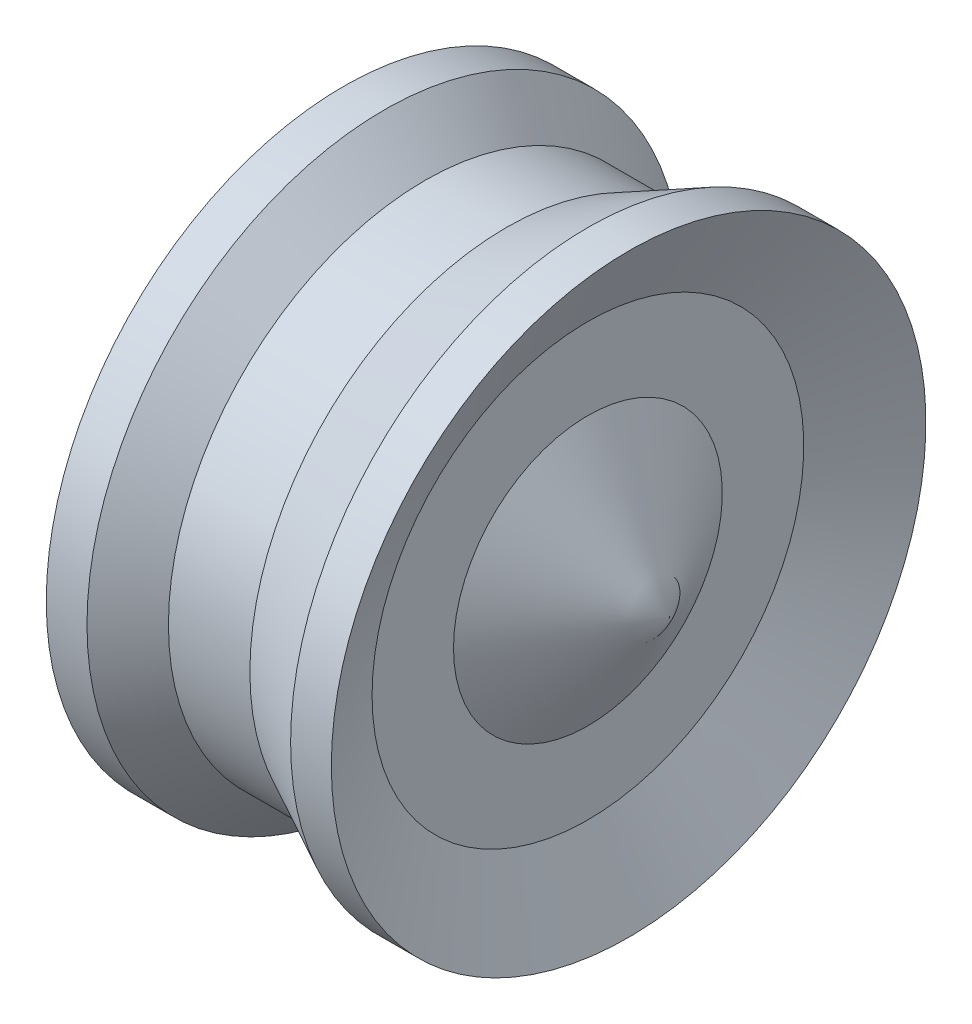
ISO-10303-21;
HEADER;
FILE_DESCRIPTION(('STEP AP214'),'2;1');
FILE_NAME('part.step','',(''),(''),'','','');
FILE_SCHEMA(('AUTOMOTIVE_DESIGN { 1 0 10303 214 1 1 1 1 }'));
ENDSEC;
DATA;
#1=APPLICATION_CONTEXT('core data for automotive mechanical design processes');
#2=APPLICATION_PROTOCOL_DEFINITION('international standard','automotive_design',2000,#1);
#3=PRODUCT_CONTEXT('',#1,'mechanical');
#4=PRODUCT('Part','Part','',(#3));
#5=PRODUCT_RELATED_PRODUCT_CATEGORY('part','',(#4));
#6=PRODUCT_DEFINITION_FORMATION('','',#4);
#7=PRODUCT_DEFINITION_CONTEXT('part definition',#1,'design');
#8=PRODUCT_DEFINITION('design','',#6,#7);
#9=PRODUCT_DEFINITION_SHAPE('','',#8);
#10=(LENGTH_UNIT() NAMED_UNIT(*) SI_UNIT(.MILLI.,.METRE.));
#11=(NAMED_UNIT(*) PLANE_ANGLE_UNIT() SI_UNIT($,.RADIAN.));
#12=(NAMED_UNIT(*) SI_UNIT($,.STERADIAN.) SOLID_ANGLE_UNIT());
#13=UNCERTAINTY_MEASURE_WITH_UNIT(LENGTH_MEASURE(1.E-05),#10,'distance_accuracy_value','');
#14=(GEOMETRIC_REPRESENTATION_CONTEXT(3) GLOBAL_UNCERTAINTY_ASSIGNED_CONTEXT((#13)) GLOBAL_UNIT_ASSIGNED_CONTEXT((#10,
#11,#12)) REPRESENTATION_CONTEXT('',''));
#15=CARTESIAN_POINT('',(0.,0.,0.));
#16=DIRECTION('',(0.,0.,1.));
#17=DIRECTION('',(1.,0.,0.));
#18=AXIS2_PLACEMENT_3D('',#15,#16,#17);
#19=CARTESIAN_POINT('',(0.,0.,0.));
#20=DIRECTION('',(-1.,0.,0.));
#21=DIRECTION('',(0.,0.,1.));
#22=AXIS2_PLACEMENT_3D('',#19,#20,#21);
#23=PLANE('',#22);
#24=CARTESIAN_POINT('',(0.,0.,0.));
#25=DIRECTION('',(-1.,0.,0.));
#26=DIRECTION('',(0.,0.,1.));
#27=AXIS2_PLACEMENT_3D('',#24,#25,#26);
#28=CIRCLE('',#27,2.);
#29=CARTESIAN_POINT('',(0.,0.,2.));
#30=VERTEX_POINT('',#29);
#31=EDGE_CURVE('E11',#30,#30,#28,.T.);
#32=ORIENTED_EDGE('',*,*,#31,.T.);
#33=EDGE_LOOP('',(#32));
#34=FACE_BOUND('',#33,.T.);
#35=ADVANCED_FACE('F43',(#34),#23,.T.);
#36=CARTESIAN_POINT('',(0.,0.,0.));
#37=DIRECTION('',(-1.,0.,0.));
#38=DIRECTION('',(0.,0.,1.));
#39=AXIS2_PLACEMENT_3D('',#36,#37,#38);
#40=CYLINDRICAL_SURFACE('',#39,2.);
#41=CARTESIAN_POINT('',(-0.5,0.,0.));
#42=DIRECTION('',(-1.,0.,0.));
#43=DIRECTION('',(0.,0.,1.));
#44=AXIS2_PLACEMENT_3D('',#41,#42,#43);
#45=CIRCLE('',#44,2.);
#46=CARTESIAN_POINT('',(-0.5,0.,2.));
#47=VERTEX_POINT('',#46);
#48=EDGE_CURVE('E49',#47,#47,#45,.T.);
#49=ORIENTED_EDGE('',*,*,#48,.T.);
#50=EDGE_LOOP('',(#49));
#51=FACE_BOUND('',#50,.T.);
#52=ORIENTED_EDGE('',*,*,#31,.F.);
#53=EDGE_LOOP('',(#52));
#54=FACE_BOUND('',#53,.T.);
#55=ADVANCED_FACE('F94',(#51,#54),#40,.F.);
#56=CARTESIAN_POINT('',(-0.5,-2.,0.));
#57=DIRECTION('',(1.,0.,0.));
#58=DIRECTION('',(0.,0.,-1.));
#59=AXIS2_PLACEMENT_3D('',#56,#57,#58);
#60=PLANE('',#59);
#61=CARTESIAN_POINT('',(-0.5,0.,0.));
#62=DIRECTION('',(-1.,0.,0.));
#63=DIRECTION('',(0.,0.,1.));
#64=AXIS2_PLACEMENT_3D('',#61,#62,#63);
#65=CIRCLE('',#64,1.5);
#66=CARTESIAN_POINT('',(-0.5,0.,1.5));
#67=VERTEX_POINT('',#66);
#68=EDGE_CURVE('E89',#67,#67,#65,.T.);
#69=ORIENTED_EDGE('',*,*,#68,.T.);
#70=EDGE_LOOP('',(#69));
#71=FACE_BOUND('',#70,.T.);
#72=ORIENTED_EDGE('',*,*,#48,.F.);
#73=EDGE_LOOP('',(#72));
#74=FACE_BOUND('',#73,.T.);
#75=ADVANCED_FACE('F97',(#71,#74),#60,.T.);
#76=CARTESIAN_POINT('',(0.,0.,0.));
#77=DIRECTION('',(-1.,0.,0.));
#78=DIRECTION('',(0.,0.,1.));
#79=AXIS2_PLACEMENT_3D('',#76,#77,#78);
#80=CYLINDRICAL_SURFACE('',#79,1.5);
#81=CARTESIAN_POINT('',(-2.,0.,0.));
#82=DIRECTION('',(-1.,0.,0.));
#83=DIRECTION('',(0.,0.,1.));
#84=AXIS2_PLACEMENT_3D('',#81,#82,#83);
#85=CIRCLE('',#84,1.5);
#86=CARTESIAN_POINT('',(-2.,0.,1.5));
#87=VERTEX_POINT('',#86);
#88=EDGE_CURVE('E86',#87,#87,#85,.T.);
#89=ORIENTED_EDGE('',*,*,#88,.T.);
#90=EDGE_LOOP('',(#89));
#91=FACE_BOUND('',#90,.T.);
#92=ORIENTED_EDGE('',*,*,#68,.F.);
#93=EDGE_LOOP('',(#92));
#94=FACE_BOUND('',#93,.T.);
#95=ADVANCED_FACE('F99',(#91,#94),#80,.F.);
#96=CARTESIAN_POINT('',(-2.,-1.5,0.));
#97=DIRECTION('',(-1.,0.,0.));
#98=DIRECTION('',(0.,0.,1.));
#99=AXIS2_PLACEMENT_3D('',#96,#97,#98);
#100=PLANE('',#99);
#101=CARTESIAN_POINT('',(-2.,0.,0.));
#102=DIRECTION('',(-1.,0.,0.));
#103=DIRECTION('',(0.,0.,1.));
#104=AXIS2_PLACEMENT_3D('',#101,#102,#103);
#105=CIRCLE('',#104,3.65);
#106=CARTESIAN_POINT('',(-2.,0.,3.65));
#107=VERTEX_POINT('',#106);
#108=EDGE_CURVE('E83',#107,#107,#105,.T.);
#109=ORIENTED_EDGE('',*,*,#108,.T.);
#110=EDGE_LOOP('',(#109));
#111=FACE_BOUND('',#110,.T.);
#112=ORIENTED_EDGE('',*,*,#88,.F.);
#113=EDGE_LOOP('',(#112));
#114=FACE_BOUND('',#113,.T.);
#115=ADVANCED_FACE('F106',(#111,#114),#100,.T.);
#116=CARTESIAN_POINT('',(0.,0.,0.));
#117=DIRECTION('',(-1.,0.,0.));
#118=DIRECTION('',(0.,0.,1.));
#119=AXIS2_PLACEMENT_3D('',#116,#117,#118);
#120=CYLINDRICAL_SURFACE('',#119,3.65);
#121=CARTESIAN_POINT('',(-1.5,0.,0.));
#122=DIRECTION('',(-1.,0.,0.));
#123=DIRECTION('',(0.,0.,1.));
#124=AXIS2_PLACEMENT_3D('',#121,#122,#123);
#125=CIRCLE('',#124,3.65);
#126=CARTESIAN_POINT('',(-1.5,0.,3.65));
#127=VERTEX_POINT('',#126);
#128=EDGE_CURVE('E80',#127,#127,#125,.T.);
#129=ORIENTED_EDGE('',*,*,#128,.T.);
#130=EDGE_LOOP('',(#129));
#131=FACE_BOUND('',#130,.T.);
#132=ORIENTED_EDGE('',*,*,#108,.F.);
#133=EDGE_LOOP('',(#132));
#134=FACE_BOUND('',#133,.T.);
#135=ADVANCED_FACE('F137',(#131,#134),#120,.T.);
#136=CARTESIAN_POINT('',(-1.5,0.,0.));
#137=DIRECTION('',(-1.,0.,0.));
#138=DIRECTION('',(0.,0.,1.));
#139=AXIS2_PLACEMENT_3D('',#136,#137,#138);
#140=CONICAL_SURFACE('',#139,3.65,0.785398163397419);
#141=CARTESIAN_POINT('',(-1.,0.,0.));
#142=DIRECTION('',(-1.,0.,0.));
#143=DIRECTION('',(0.,0.,1.));
#144=AXIS2_PLACEMENT_3D('',#141,#142,#143);
#145=CIRCLE('',#144,3.15000000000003);
#146=CARTESIAN_POINT('',(-1.,0.,3.15000000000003));
#147=VERTEX_POINT('',#146);
#148=EDGE_CURVE('E77',#147,#147,#145,.T.);
#149=ORIENTED_EDGE('',*,*,#148,.T.);
#150=EDGE_LOOP('',(#149));
#151=FACE_BOUND('',#150,.T.);
#152=ORIENTED_EDGE('',*,*,#128,.F.);
#153=EDGE_LOOP('',(#152));
#154=FACE_BOUND('',#153,.T.);
#155=ADVANCED_FACE('F147',(#151,#154),#140,.T.);
#156=CARTESIAN_POINT('',(0.,0.,0.));
#157=DIRECTION('',(-1.,0.,0.));
#158=DIRECTION('',(0.,0.,1.));
#159=AXIS2_PLACEMENT_3D('',#156,#157,#158);
#160=CYLINDRICAL_SURFACE('',#159,3.15000000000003);
#161=CARTESIAN_POINT('',(0.,0.,0.));
#162=DIRECTION('',(-1.,0.,0.));
#163=DIRECTION('',(0.,0.,1.));
#164=AXIS2_PLACEMENT_3D('',#161,#162,#163);
#165=CIRCLE('',#164,3.15000000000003);
#166=CARTESIAN_POINT('',(0.,0.,3.15000000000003));
#167=VERTEX_POINT('',#166);
#168=EDGE_CURVE('E74',#167,#167,#165,.T.);
#169=ORIENTED_EDGE('',*,*,#168,.T.);
#170=EDGE_LOOP('',(#169));
#171=FACE_BOUND('',#170,.T.);
#172=ORIENTED_EDGE('',*,*,#148,.F.);
#173=EDGE_LOOP('',(#172));
#174=FACE_BOUND('',#173,.T.);
#175=ADVANCED_FACE('F157',(#171,#174),#160,.T.);
#176=CARTESIAN_POINT('',(0.,0.,0.));
#177=DIRECTION('',(1.,0.,0.));
#178=DIRECTION('',(0.,0.,-1.));
#179=AXIS2_PLACEMENT_3D('',#176,#177,#178);
#180=CONICAL_SURFACE('',#179,3.15000000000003,0.463647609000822);
#181=CARTESIAN_POINT('',(0.999999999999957,0.,0.));
#182=DIRECTION('',(-1.,0.,0.));
#183=DIRECTION('',(0.,0.,1.));
#184=AXIS2_PLACEMENT_3D('',#181,#182,#183);
#185=CIRCLE('',#184,3.65000000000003);
#186=CARTESIAN_POINT('',(0.999999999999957,0.,3.65000000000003));
#187=VERTEX_POINT('',#186);
#188=EDGE_CURVE('E71',#187,#187,#185,.T.);
#189=ORIENTED_EDGE('',*,*,#188,.T.);
#190=EDGE_LOOP('',(#189));
#191=FACE_BOUND('',#190,.T.);
#192=ORIENTED_EDGE('',*,*,#168,.F.);
#193=EDGE_LOOP('',(#192));
#194=FACE_BOUND('',#193,.T.);
#195=ADVANCED_FACE('F167',(#191,#194),#180,.T.);
#196=CARTESIAN_POINT('',(0.,0.,0.));
#197=DIRECTION('',(-1.,0.,0.));
#198=DIRECTION('',(0.,0.,1.));
#199=AXIS2_PLACEMENT_3D('',#196,#197,#198);
#200=CYLINDRICAL_SURFACE('',#199,3.65000000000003);
#201=CARTESIAN_POINT('',(1.49999999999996,0.,0.));
#202=DIRECTION('',(-1.,0.,0.));
#203=DIRECTION('',(0.,0.,1.));
#204=AXIS2_PLACEMENT_3D('',#201,#202,#203);
#205=CIRCLE('',#204,3.65000000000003);
#206=CARTESIAN_POINT('',(1.49999999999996,0.,3.65000000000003));
#207=VERTEX_POINT('',#206);
#208=EDGE_CURVE('E66',#207,#207,#205,.T.);
#209=ORIENTED_EDGE('',*,*,#208,.T.);
#210=EDGE_LOOP('',(#209));
#211=FACE_BOUND('',#210,.T.);
#212=ORIENTED_EDGE('',*,*,#188,.F.);
#213=EDGE_LOOP('',(#212));
#214=FACE_BOUND('',#213,.T.);
#215=ADVANCED_FACE('F177',(#211,#214),#200,.T.);
#216=CARTESIAN_POINT('',(1.49999999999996,0.,0.));
#217=DIRECTION('',(1.,0.,0.));
#218=DIRECTION('',(0.,0.,-1.));
#219=AXIS2_PLACEMENT_3D('',#216,#217,#218);
#220=CONICAL_SURFACE('',#219,3.65000000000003,1.10714871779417);
#221=CARTESIAN_POINT('',(1.00000000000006,0.,0.));
#222=DIRECTION('',(-1.,0.,0.));
#223=DIRECTION('',(0.,0.,1.));
#224=AXIS2_PLACEMENT_3D('',#221,#222,#223);
#225=CIRCLE('',#224,2.65000000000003);
#226=CARTESIAN_POINT('',(1.00000000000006,0.,2.65000000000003));
#227=VERTEX_POINT('',#226);
#228=EDGE_CURVE('E63',#227,#227,#225,.T.);
#229=ORIENTED_EDGE('',*,*,#228,.T.);
#230=EDGE_LOOP('',(#229));
#231=FACE_BOUND('',#230,.T.);
#232=ORIENTED_EDGE('',*,*,#208,.F.);
#233=EDGE_LOOP('',(#232));
#234=FACE_BOUND('',#233,.T.);
#235=ADVANCED_FACE('F187',(#231,#234),#220,.F.);
#236=CARTESIAN_POINT('',(1.00000000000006,-2.65000000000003,0.));
#237=DIRECTION('',(1.,0.,0.));
#238=DIRECTION('',(0.,0.,-1.));
#239=AXIS2_PLACEMENT_3D('',#236,#237,#238);
#240=PLANE('',#239);
#241=CARTESIAN_POINT('',(1.00000000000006,0.,0.));
#242=DIRECTION('',(-1.,0.,0.));
#243=DIRECTION('',(0.,0.,1.));
#244=AXIS2_PLACEMENT_3D('',#241,#242,#243);
#245=CIRCLE('',#244,1.65);
#246=CARTESIAN_POINT('',(1.00000000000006,0.,1.65));
#247=VERTEX_POINT('',#246);
#248=EDGE_CURVE('E61',#247,#247,#245,.T.);
#249=ORIENTED_EDGE('',*,*,#248,.T.);
#250=EDGE_LOOP('',(#249));
#251=FACE_BOUND('',#250,.T.);
#252=ORIENTED_EDGE('',*,*,#228,.F.);
#253=EDGE_LOOP('',(#252));
#254=FACE_BOUND('',#253,.T.);
#255=ADVANCED_FACE('F57',(#251,#254),#240,.T.);
#256=CARTESIAN_POINT('',(1.00000000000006,0.,0.));
#257=DIRECTION('',(-1.,0.,0.));
#258=DIRECTION('',(0.,0.,1.));
#259=AXIS2_PLACEMENT_3D('',#256,#257,#258);
#260=CONICAL_SURFACE('',#259,1.65,1.02593241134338);
#261=CARTESIAN_POINT('',(2.,0.,0.));
#262=VERTEX_POINT('',#261);
#263=VERTEX_LOOP('',#262);
#264=FACE_BOUND('',#263,.T.);
#265=ORIENTED_EDGE('',*,*,#248,.F.);
#266=EDGE_LOOP('',(#265));
#267=FACE_BOUND('',#266,.T.);
#268=ADVANCED_FACE('F54',(#264,#267),#260,.T.);
#269=CLOSED_SHELL('',(#35,#55,#75,#95,#115,#135,#155,#175,#195,#215,#235,#255,#268));
#270=MANIFOLD_SOLID_BREP('B2',#269);
#271=ADVANCED_BREP_SHAPE_REPRESENTATION('',(#18,#270),#14);
#272=SHAPE_DEFINITION_REPRESENTATION(#9,#271);
ENDSEC;
END-ISO-10303-21;
